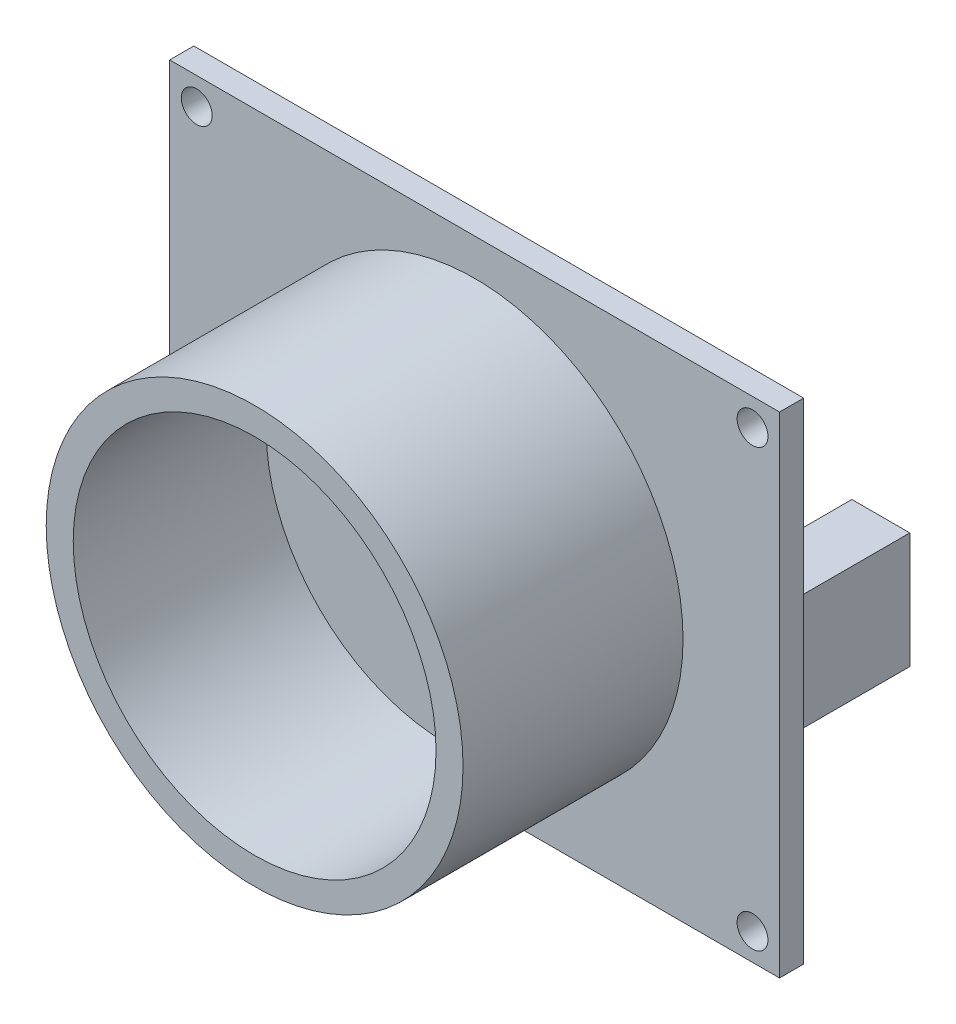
from build123d import *

# Parameters (mm, degrees)
SKETCH1_W         = 40.132
SKETCH1_H         = 32.258
PCB_DEPTH         = 1.5875
SKETCH2_R         = 1.016
MOUNT_HOLES_DEPTH = 1.5875
SKETCH3_R         = 13.716
LENS_MOUNT_DEPTH  = 14.478
SKETCH5_R         = 11.938
MOUNT_ID_DEPTH    = 12.7
SKETCH4_W         = 3.81
SKETCH4_H         = 7.62
USB_DEPTH         = 8.128


with BuildPart() as part:
    # Sketch1 → pcb (new body)
    with BuildSketch(Plane.XY):
        Rectangle(SKETCH1_W, SKETCH1_H)
    extrude(amount=PCB_DEPTH)

    # Sketch2 → mount_holes (cut)
    with BuildSketch(Plane.XY.offset(1.5875)):
        with Locations((18.288, 14.351)):
            Circle(SKETCH2_R)
        with Locations(Location((18.288, -14.351, 0), (0, 0, 180))):
            Circle(SKETCH2_R)
        with Locations((-18.288, -14.351)):
            Circle(SKETCH2_R)
        with Locations(Location((-18.288, 14.351, 0), (0, 0, 180))):
            Circle(SKETCH2_R)
    extrude(amount=-MOUNT_HOLES_DEPTH, mode=Mode.SUBTRACT)

    # Sketch3 → lens_mount (add)
    with BuildSketch(Plane.XY.offset(1.5875)):
        with Locations(Location((0, 0, 0), (0, 0, 180))):
            Circle(SKETCH3_R)
    extrude(amount=LENS_MOUNT_DEPTH)

    # Sketch5 → mount_id (cut)
    with BuildSketch(Plane.XY.offset(16.0655)):
        Circle(SKETCH5_R)
    extrude(amount=-MOUNT_ID_DEPTH, mode=Mode.SUBTRACT)

    # Sketch4 → usb (add)
    with BuildSketch(Plane(origin=(0, 0, 0), x_dir=(-1, 0, 0), z_dir=(0, 0, -1))):
        with Locations((-17.018, 0)):
            Rectangle(SKETCH4_W, SKETCH4_H)
    extrude(amount=USB_DEPTH)


solid = part.part
